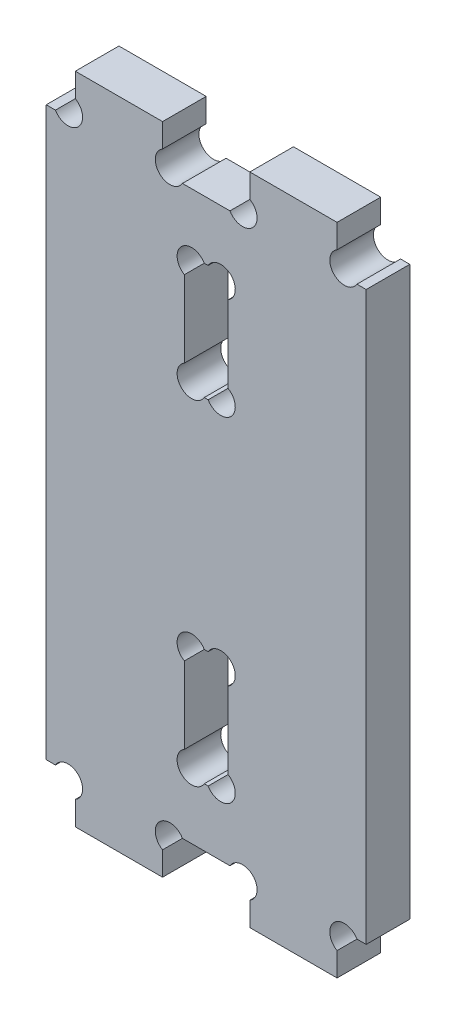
ISO-10303-21;
HEADER;
FILE_DESCRIPTION(('STEP AP214'),'2;1');
FILE_NAME('part.step','',(''),(''),'','','');
FILE_SCHEMA(('AUTOMOTIVE_DESIGN { 1 0 10303 214 1 1 1 1 }'));
ENDSEC;
DATA;
#1=APPLICATION_CONTEXT('core data for automotive mechanical design processes');
#2=APPLICATION_PROTOCOL_DEFINITION('international standard','automotive_design',2000,#1);
#3=PRODUCT_CONTEXT('',#1,'mechanical');
#4=PRODUCT('Part','Part','',(#3));
#5=PRODUCT_RELATED_PRODUCT_CATEGORY('part','',(#4));
#6=PRODUCT_DEFINITION_FORMATION('','',#4);
#7=PRODUCT_DEFINITION_CONTEXT('part definition',#1,'design');
#8=PRODUCT_DEFINITION('design','',#6,#7);
#9=PRODUCT_DEFINITION_SHAPE('','',#8);
#10=(LENGTH_UNIT() NAMED_UNIT(*) SI_UNIT(.MILLI.,.METRE.));
#11=(NAMED_UNIT(*) PLANE_ANGLE_UNIT() SI_UNIT($,.RADIAN.));
#12=(NAMED_UNIT(*) SI_UNIT($,.STERADIAN.) SOLID_ANGLE_UNIT());
#13=UNCERTAINTY_MEASURE_WITH_UNIT(LENGTH_MEASURE(1.E-05),#10,'distance_accuracy_value','');
#14=(GEOMETRIC_REPRESENTATION_CONTEXT(3) GLOBAL_UNCERTAINTY_ASSIGNED_CONTEXT((#13)) GLOBAL_UNIT_ASSIGNED_CONTEXT((#10,
#11,#12)) REPRESENTATION_CONTEXT('',''));
#15=CARTESIAN_POINT('',(0.,0.,0.));
#16=DIRECTION('',(0.,0.,1.));
#17=DIRECTION('',(1.,0.,0.));
#18=AXIS2_PLACEMENT_3D('',#15,#16,#17);
#19=CARTESIAN_POINT('',(0.,0.,0.));
#20=DIRECTION('',(0.,0.,-1.));
#21=DIRECTION('',(-1.,0.,0.));
#22=AXIS2_PLACEMENT_3D('',#19,#20,#21);
#23=PLANE('',#22);
#24=CARTESIAN_POINT('',(-1.00000000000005,-8.,0.));
#25=DIRECTION('',(0.,0.,1.));
#26=DIRECTION('',(1.,0.,0.));
#27=AXIS2_PLACEMENT_3D('',#24,#25,#26);
#28=CIRCLE('',#27,0.999999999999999);
#29=CARTESIAN_POINT('',(-0.133974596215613,-7.5,0.));
#30=VERTEX_POINT('',#29);
#31=CARTESIAN_POINT('',(-1.50000000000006,-8.86602540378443,0.));
#32=VERTEX_POINT('',#31);
#33=EDGE_CURVE('E561',#30,#32,#28,.T.);
#34=ORIENTED_EDGE('',*,*,#33,.T.);
#35=DIRECTION('',(0.,1.,0.));
#36=VECTOR('',#35,1.);
#37=CARTESIAN_POINT('',(-1.50000000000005,0.,0.));
#38=LINE('',#37,#36);
#39=CARTESIAN_POINT('',(-1.50000000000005,-14.1339745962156,0.));
#40=VERTEX_POINT('',#39);
#41=EDGE_CURVE('E397',#40,#32,#38,.T.);
#42=ORIENTED_EDGE('',*,*,#41,.F.);
#43=CARTESIAN_POINT('',(-1.00000000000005,-15.,0.));
#44=DIRECTION('',(0.,0.,1.));
#45=DIRECTION('',(1.,0.,0.));
#46=AXIS2_PLACEMENT_3D('',#43,#44,#45);
#47=CIRCLE('',#46,0.999999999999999);
#48=CARTESIAN_POINT('',(-0.133974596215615,-15.5,0.));
#49=VERTEX_POINT('',#48);
#50=EDGE_CURVE('E590',#40,#49,#47,.T.);
#51=ORIENTED_EDGE('',*,*,#50,.T.);
#52=DIRECTION('',(-1.,0.,0.));
#53=VECTOR('',#52,1.);
#54=CARTESIAN_POINT('',(0.,-15.5,0.));
#55=LINE('',#54,#53);
#56=CARTESIAN_POINT('',(0.133974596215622,-15.5,0.));
#57=VERTEX_POINT('',#56);
#58=EDGE_CURVE('E400',#57,#49,#55,.T.);
#59=ORIENTED_EDGE('',*,*,#58,.F.);
#60=CARTESIAN_POINT('',(1.00000000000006,-15.,0.));
#61=DIRECTION('',(0.,0.,1.));
#62=DIRECTION('',(1.,0.,0.));
#63=AXIS2_PLACEMENT_3D('',#60,#61,#62);
#64=CIRCLE('',#63,0.999999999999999);
#65=CARTESIAN_POINT('',(1.49999999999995,-14.1339745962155,0.));
#66=VERTEX_POINT('',#65);
#67=EDGE_CURVE('E580',#57,#66,#64,.T.);
#68=ORIENTED_EDGE('',*,*,#67,.T.);
#69=DIRECTION('',(0.,-1.,0.));
#70=VECTOR('',#69,1.);
#71=CARTESIAN_POINT('',(1.49999999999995,0.,0.));
#72=LINE('',#71,#70);
#73=CARTESIAN_POINT('',(1.49999999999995,-8.8660254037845,0.));
#74=VERTEX_POINT('',#73);
#75=EDGE_CURVE('E401',#74,#66,#72,.T.);
#76=ORIENTED_EDGE('',*,*,#75,.F.);
#77=CARTESIAN_POINT('',(1.00000000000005,-8.,0.));
#78=DIRECTION('',(0.,0.,1.));
#79=DIRECTION('',(1.,0.,0.));
#80=AXIS2_PLACEMENT_3D('',#77,#78,#79);
#81=CIRCLE('',#80,0.999999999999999);
#82=CARTESIAN_POINT('',(0.133974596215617,-7.5,0.));
#83=VERTEX_POINT('',#82);
#84=EDGE_CURVE('E546',#74,#83,#81,.T.);
#85=ORIENTED_EDGE('',*,*,#84,.T.);
#86=DIRECTION('',(1.,0.,0.));
#87=VECTOR('',#86,1.);
#88=CARTESIAN_POINT('',(0.,-7.5,0.));
#89=LINE('',#88,#87);
#90=EDGE_CURVE('E39',#30,#83,#89,.T.);
#91=ORIENTED_EDGE('',*,*,#90,.F.);
#92=EDGE_LOOP('',(#34,#42,#51,#59,#68,#76,#85,#91));
#93=FACE_BOUND('',#92,.T.);
#94=DIRECTION('',(-1.,0.,0.));
#95=VECTOR('',#94,1.);
#96=CARTESIAN_POINT('',(-11.,19.5,0.));
#97=LINE('',#96,#95);
#98=CARTESIAN_POINT('',(-10.3660254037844,19.5,0.));
#99=VERTEX_POINT('',#98);
#100=CARTESIAN_POINT('',(-11.,19.5,0.));
#101=VERTEX_POINT('',#100);
#102=EDGE_CURVE('E368',#99,#101,#97,.T.);
#103=ORIENTED_EDGE('',*,*,#102,.F.);
#104=CARTESIAN_POINT('',(-9.5,20.,0.));
#105=DIRECTION('',(0.,0.,1.));
#106=DIRECTION('',(1.,0.,0.));
#107=AXIS2_PLACEMENT_3D('',#104,#105,#106);
#108=CIRCLE('',#107,0.999999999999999);
#109=CARTESIAN_POINT('',(-9.,20.8660254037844,0.));
#110=VERTEX_POINT('',#109);
#111=EDGE_CURVE('E583',#99,#110,#108,.T.);
#112=ORIENTED_EDGE('',*,*,#111,.T.);
#113=DIRECTION('',(0.,-1.,0.));
#114=VECTOR('',#113,1.);
#115=CARTESIAN_POINT('',(-9.,19.5,0.));
#116=LINE('',#115,#114);
#117=CARTESIAN_POINT('',(-9.,22.5,0.));
#118=VERTEX_POINT('',#117);
#119=EDGE_CURVE('E490',#118,#110,#116,.T.);
#120=ORIENTED_EDGE('',*,*,#119,.F.);
#121=DIRECTION('',(-1.,0.,0.));
#122=VECTOR('',#121,1.);
#123=CARTESIAN_POINT('',(-9.,22.5,0.));
#124=LINE('',#123,#122);
#125=CARTESIAN_POINT('',(-3.,22.5,0.));
#126=VERTEX_POINT('',#125);
#127=EDGE_CURVE('E495',#126,#118,#124,.T.);
#128=ORIENTED_EDGE('',*,*,#127,.F.);
#129=DIRECTION('',(0.,1.,0.));
#130=VECTOR('',#129,1.);
#131=CARTESIAN_POINT('',(-3.,19.5,0.));
#132=LINE('',#131,#130);
#133=CARTESIAN_POINT('',(-3.,20.8660254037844,0.));
#134=VERTEX_POINT('',#133);
#135=EDGE_CURVE('E502',#134,#126,#132,.T.);
#136=ORIENTED_EDGE('',*,*,#135,.F.);
#137=CARTESIAN_POINT('',(-2.5,20.,0.));
#138=DIRECTION('',(0.,0.,1.));
#139=DIRECTION('',(1.,0.,0.));
#140=AXIS2_PLACEMENT_3D('',#137,#138,#139);
#141=CIRCLE('',#140,0.999999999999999);
#142=CARTESIAN_POINT('',(-1.63397459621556,19.5,0.));
#143=VERTEX_POINT('',#142);
#144=EDGE_CURVE('E612',#134,#143,#141,.T.);
#145=ORIENTED_EDGE('',*,*,#144,.T.);
#146=CARTESIAN_POINT('',(1.63397459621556,19.5,0.));
#147=VERTEX_POINT('',#146);
#148=EDGE_CURVE('E373',#147,#143,#97,.T.);
#149=ORIENTED_EDGE('',*,*,#148,.F.);
#150=CARTESIAN_POINT('',(2.5,20.,0.));
#151=DIRECTION('',(0.,0.,1.));
#152=DIRECTION('',(1.,0.,0.));
#153=AXIS2_PLACEMENT_3D('',#150,#151,#152);
#154=CIRCLE('',#153,0.999999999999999);
#155=CARTESIAN_POINT('',(3.,20.8660254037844,0.));
#156=VERTEX_POINT('',#155);
#157=EDGE_CURVE('E602',#147,#156,#154,.T.);
#158=ORIENTED_EDGE('',*,*,#157,.T.);
#159=DIRECTION('',(0.,-1.,0.));
#160=VECTOR('',#159,1.);
#161=CARTESIAN_POINT('',(3.,19.5,0.));
#162=LINE('',#161,#160);
#163=CARTESIAN_POINT('',(3.,22.5,0.));
#164=VERTEX_POINT('',#163);
#165=EDGE_CURVE('E474',#164,#156,#162,.T.);
#166=ORIENTED_EDGE('',*,*,#165,.F.);
#167=DIRECTION('',(-1.,0.,0.));
#168=VECTOR('',#167,1.);
#169=CARTESIAN_POINT('',(9.,22.5,0.));
#170=LINE('',#169,#168);
#171=CARTESIAN_POINT('',(9.,22.5,0.));
#172=VERTEX_POINT('',#171);
#173=EDGE_CURVE('E481',#172,#164,#170,.T.);
#174=ORIENTED_EDGE('',*,*,#173,.F.);
#175=DIRECTION('',(0.,1.,0.));
#176=VECTOR('',#175,1.);
#177=CARTESIAN_POINT('',(9.,19.5,0.));
#178=LINE('',#177,#176);
#179=CARTESIAN_POINT('',(9.,20.8660254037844,0.));
#180=VERTEX_POINT('',#179);
#181=EDGE_CURVE('E470',#180,#172,#178,.T.);
#182=ORIENTED_EDGE('',*,*,#181,.F.);
#183=CARTESIAN_POINT('',(9.5,20.,0.));
#184=DIRECTION('',(0.,0.,1.));
#185=DIRECTION('',(1.,0.,0.));
#186=AXIS2_PLACEMENT_3D('',#183,#184,#185);
#187=CIRCLE('',#186,0.999999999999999);
#188=CARTESIAN_POINT('',(10.3660254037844,19.5,0.));
#189=VERTEX_POINT('',#188);
#190=EDGE_CURVE('E634',#180,#189,#187,.T.);
#191=ORIENTED_EDGE('',*,*,#190,.T.);
#192=CARTESIAN_POINT('',(11.,19.5,0.));
#193=VERTEX_POINT('',#192);
#194=EDGE_CURVE('E369',#193,#189,#97,.T.);
#195=ORIENTED_EDGE('',*,*,#194,.F.);
#196=DIRECTION('',(0.,1.,0.));
#197=VECTOR('',#196,1.);
#198=CARTESIAN_POINT('',(11.,-19.5,0.));
#199=LINE('',#198,#197);
#200=CARTESIAN_POINT('',(11.,-19.5,0.));
#201=VERTEX_POINT('',#200);
#202=EDGE_CURVE('E343',#201,#193,#199,.T.);
#203=ORIENTED_EDGE('',*,*,#202,.F.);
#204=DIRECTION('',(1.,0.,0.));
#205=VECTOR('',#204,1.);
#206=CARTESIAN_POINT('',(-11.,-19.5,0.));
#207=LINE('',#206,#205);
#208=CARTESIAN_POINT('',(10.3660254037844,-19.5,0.));
#209=VERTEX_POINT('',#208);
#210=EDGE_CURVE('E375',#209,#201,#207,.T.);
#211=ORIENTED_EDGE('',*,*,#210,.F.);
#212=CARTESIAN_POINT('',(9.50000000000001,-20.,0.));
#213=DIRECTION('',(0.,0.,1.));
#214=DIRECTION('',(1.,0.,0.));
#215=AXIS2_PLACEMENT_3D('',#212,#213,#214);
#216=CIRCLE('',#215,0.999999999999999);
#217=CARTESIAN_POINT('',(9.00000000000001,-20.8660254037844,0.));
#218=VERTEX_POINT('',#217);
#219=EDGE_CURVE('E645',#209,#218,#216,.T.);
#220=ORIENTED_EDGE('',*,*,#219,.T.);
#221=DIRECTION('',(0.,1.,0.));
#222=VECTOR('',#221,1.);
#223=CARTESIAN_POINT('',(9.00000000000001,-19.5,0.));
#224=LINE('',#223,#222);
#225=CARTESIAN_POINT('',(9.00000000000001,-22.5,0.));
#226=VERTEX_POINT('',#225);
#227=EDGE_CURVE('E450',#226,#218,#224,.T.);
#228=ORIENTED_EDGE('',*,*,#227,.F.);
#229=DIRECTION('',(1.,0.,0.));
#230=VECTOR('',#229,1.);
#231=CARTESIAN_POINT('',(9.00000000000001,-22.5,0.));
#232=LINE('',#231,#230);
#233=CARTESIAN_POINT('',(3.00000000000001,-22.5,0.));
#234=VERTEX_POINT('',#233);
#235=EDGE_CURVE('E455',#234,#226,#232,.T.);
#236=ORIENTED_EDGE('',*,*,#235,.F.);
#237=DIRECTION('',(0.,-1.,0.));
#238=VECTOR('',#237,1.);
#239=CARTESIAN_POINT('',(3.00000000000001,-19.5,0.));
#240=LINE('',#239,#238);
#241=CARTESIAN_POINT('',(3.00000000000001,-20.8660254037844,0.));
#242=VERTEX_POINT('',#241);
#243=EDGE_CURVE('E462',#242,#234,#240,.T.);
#244=ORIENTED_EDGE('',*,*,#243,.F.);
#245=CARTESIAN_POINT('',(2.50000000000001,-20.,0.));
#246=DIRECTION('',(0.,0.,1.));
#247=DIRECTION('',(1.,0.,0.));
#248=AXIS2_PLACEMENT_3D('',#245,#246,#247);
#249=CIRCLE('',#248,0.999999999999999);
#250=CARTESIAN_POINT('',(1.63397459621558,-19.5,0.));
#251=VERTEX_POINT('',#250);
#252=EDGE_CURVE('E419',#242,#251,#249,.T.);
#253=ORIENTED_EDGE('',*,*,#252,.T.);
#254=CARTESIAN_POINT('',(-1.63397459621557,-19.5,0.));
#255=VERTEX_POINT('',#254);
#256=EDGE_CURVE('E378',#255,#251,#207,.T.);
#257=ORIENTED_EDGE('',*,*,#256,.F.);
#258=CARTESIAN_POINT('',(-2.5,-20.,0.));
#259=DIRECTION('',(0.,0.,1.));
#260=DIRECTION('',(1.,0.,0.));
#261=AXIS2_PLACEMENT_3D('',#258,#259,#260);
#262=CIRCLE('',#261,0.999999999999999);
#263=CARTESIAN_POINT('',(-3.,-20.8660254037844,0.));
#264=VERTEX_POINT('',#263);
#265=EDGE_CURVE('E665',#255,#264,#262,.T.);
#266=ORIENTED_EDGE('',*,*,#265,.T.);
#267=DIRECTION('',(0.,1.,0.));
#268=VECTOR('',#267,1.);
#269=CARTESIAN_POINT('',(-3.,-19.5,0.));
#270=LINE('',#269,#268);
#271=CARTESIAN_POINT('',(-3.,-22.5,0.));
#272=VERTEX_POINT('',#271);
#273=EDGE_CURVE('E434',#272,#264,#270,.T.);
#274=ORIENTED_EDGE('',*,*,#273,.F.);
#275=DIRECTION('',(1.,0.,0.));
#276=VECTOR('',#275,1.);
#277=CARTESIAN_POINT('',(-9.,-22.5,0.));
#278=LINE('',#277,#276);
#279=CARTESIAN_POINT('',(-9.,-22.5,0.));
#280=VERTEX_POINT('',#279);
#281=EDGE_CURVE('E441',#280,#272,#278,.T.);
#282=ORIENTED_EDGE('',*,*,#281,.F.);
#283=DIRECTION('',(0.,-1.,0.));
#284=VECTOR('',#283,1.);
#285=CARTESIAN_POINT('',(-9.,-19.5,0.));
#286=LINE('',#285,#284);
#287=CARTESIAN_POINT('',(-9.,-20.8660254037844,0.));
#288=VERTEX_POINT('',#287);
#289=EDGE_CURVE('E430',#288,#280,#286,.T.);
#290=ORIENTED_EDGE('',*,*,#289,.F.);
#291=CARTESIAN_POINT('',(-9.5,-20.,0.));
#292=DIRECTION('',(0.,0.,1.));
#293=DIRECTION('',(1.,0.,0.));
#294=AXIS2_PLACEMENT_3D('',#291,#292,#293);
#295=CIRCLE('',#294,0.999999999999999);
#296=CARTESIAN_POINT('',(-10.3660254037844,-19.5,0.));
#297=VERTEX_POINT('',#296);
#298=EDGE_CURVE('E407',#288,#297,#295,.T.);
#299=ORIENTED_EDGE('',*,*,#298,.T.);
#300=CARTESIAN_POINT('',(-11.,-19.5,0.));
#301=VERTEX_POINT('',#300);
#302=EDGE_CURVE('E353',#301,#297,#207,.T.);
#303=ORIENTED_EDGE('',*,*,#302,.F.);
#304=DIRECTION('',(0.,-1.,0.));
#305=VECTOR('',#304,1.);
#306=CARTESIAN_POINT('',(-11.,-19.5,0.));
#307=LINE('',#306,#305);
#308=EDGE_CURVE('E372',#101,#301,#307,.T.);
#309=ORIENTED_EDGE('',*,*,#308,.F.);
#310=EDGE_LOOP('',(#103,#112,#120,#128,#136,#145,#149,#158,#166,#174,#182,#191,#195,#203,#211,
#220,#228,#236,#244,#253,#257,#266,#274,#282,#290,#299,#303,#309));
#311=FACE_BOUND('',#310,.T.);
#312=DIRECTION('',(1.,0.,0.));
#313=VECTOR('',#312,1.);
#314=CARTESIAN_POINT('',(0.,15.5,0.));
#315=LINE('',#314,#313);
#316=CARTESIAN_POINT('',(-0.133974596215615,15.5,0.));
#317=VERTEX_POINT('',#316);
#318=CARTESIAN_POINT('',(0.133974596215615,15.5,0.));
#319=VERTEX_POINT('',#318);
#320=EDGE_CURVE('E390',#317,#319,#315,.T.);
#321=ORIENTED_EDGE('',*,*,#320,.F.);
#322=CARTESIAN_POINT('',(-1.00000000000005,15.,0.));
#323=DIRECTION('',(0.,0.,1.));
#324=DIRECTION('',(1.,0.,0.));
#325=AXIS2_PLACEMENT_3D('',#322,#323,#324);
#326=CIRCLE('',#325,0.999999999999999);
#327=CARTESIAN_POINT('',(-1.50000000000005,14.1339745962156,0.));
#328=VERTEX_POINT('',#327);
#329=EDGE_CURVE('E323',#317,#328,#326,.T.);
#330=ORIENTED_EDGE('',*,*,#329,.T.);
#331=DIRECTION('',(0.,1.,0.));
#332=VECTOR('',#331,1.);
#333=CARTESIAN_POINT('',(-1.50000000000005,0.,0.));
#334=LINE('',#333,#332);
#335=CARTESIAN_POINT('',(-1.50000000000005,8.86602540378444,0.));
#336=VERTEX_POINT('',#335);
#337=EDGE_CURVE('E332',#336,#328,#334,.T.);
#338=ORIENTED_EDGE('',*,*,#337,.F.);
#339=CARTESIAN_POINT('',(-1.00000000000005,8.,0.));
#340=DIRECTION('',(0.,0.,1.));
#341=DIRECTION('',(1.,0.,0.));
#342=AXIS2_PLACEMENT_3D('',#339,#340,#341);
#343=CIRCLE('',#342,0.999999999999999);
#344=CARTESIAN_POINT('',(-0.133974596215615,7.5,0.));
#345=VERTEX_POINT('',#344);
#346=EDGE_CURVE('E551',#336,#345,#343,.T.);
#347=ORIENTED_EDGE('',*,*,#346,.T.);
#348=DIRECTION('',(-1.,0.,0.));
#349=VECTOR('',#348,1.);
#350=CARTESIAN_POINT('',(0.,7.5,0.));
#351=LINE('',#350,#349);
#352=CARTESIAN_POINT('',(0.133974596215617,7.5,0.));
#353=VERTEX_POINT('',#352);
#354=EDGE_CURVE('E393',#353,#345,#351,.T.);
#355=ORIENTED_EDGE('',*,*,#354,.F.);
#356=CARTESIAN_POINT('',(1.00000000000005,8.,0.));
#357=DIRECTION('',(0.,0.,1.));
#358=DIRECTION('',(1.,0.,0.));
#359=AXIS2_PLACEMENT_3D('',#356,#357,#358);
#360=CIRCLE('',#359,0.999999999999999);
#361=CARTESIAN_POINT('',(1.49999999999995,8.8660254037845,0.));
#362=VERTEX_POINT('',#361);
#363=EDGE_CURVE('E543',#353,#362,#360,.T.);
#364=ORIENTED_EDGE('',*,*,#363,.T.);
#365=DIRECTION('',(0.,-1.,0.));
#366=VECTOR('',#365,1.);
#367=CARTESIAN_POINT('',(1.49999999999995,0.,0.));
#368=LINE('',#367,#366);
#369=CARTESIAN_POINT('',(1.49999999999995,14.1339745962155,0.));
#370=VERTEX_POINT('',#369);
#371=EDGE_CURVE('E395',#370,#362,#368,.T.);
#372=ORIENTED_EDGE('',*,*,#371,.F.);
#373=CARTESIAN_POINT('',(1.00000000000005,15.,0.));
#374=DIRECTION('',(0.,0.,1.));
#375=DIRECTION('',(1.,0.,0.));
#376=AXIS2_PLACEMENT_3D('',#373,#374,#375);
#377=CIRCLE('',#376,0.999999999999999);
#378=EDGE_CURVE('E333',#370,#319,#377,.T.);
#379=ORIENTED_EDGE('',*,*,#378,.T.);
#380=EDGE_LOOP('',(#321,#330,#338,#347,#355,#364,#372,#379));
#381=FACE_BOUND('',#380,.T.);
#382=ADVANCED_FACE('F35',(#93,#311,#381),#23,.T.);
#383=CARTESIAN_POINT('',(0.,0.,3.));
#384=DIRECTION('',(0.,0.,-1.));
#385=DIRECTION('',(-1.,0.,0.));
#386=AXIS2_PLACEMENT_3D('',#383,#384,#385);
#387=PLANE('',#386);
#388=CARTESIAN_POINT('',(-9.5,20.,3.));
#389=DIRECTION('',(0.,0.,1.));
#390=DIRECTION('',(1.,0.,0.));
#391=AXIS2_PLACEMENT_3D('',#388,#389,#390);
#392=CIRCLE('',#391,0.999999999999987);
#393=CARTESIAN_POINT('',(-10.3660254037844,19.5,3.));
#394=VERTEX_POINT('',#393);
#395=CARTESIAN_POINT('',(-9.,20.8660254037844,3.));
#396=VERTEX_POINT('',#395);
#397=EDGE_CURVE('E600',#394,#396,#392,.T.);
#398=ORIENTED_EDGE('',*,*,#397,.F.);
#399=DIRECTION('',(-1.,0.,0.));
#400=VECTOR('',#399,1.);
#401=CARTESIAN_POINT('',(-11.,19.5,3.));
#402=LINE('',#401,#400);
#403=CARTESIAN_POINT('',(-11.,19.5,3.));
#404=VERTEX_POINT('',#403);
#405=EDGE_CURVE('E352',#394,#404,#402,.T.);
#406=ORIENTED_EDGE('',*,*,#405,.T.);
#407=DIRECTION('',(0.,-1.,0.));
#408=VECTOR('',#407,1.);
#409=CARTESIAN_POINT('',(-11.,-19.5,3.));
#410=LINE('',#409,#408);
#411=CARTESIAN_POINT('',(-11.,-19.5,3.));
#412=VERTEX_POINT('',#411);
#413=EDGE_CURVE('E357',#404,#412,#410,.T.);
#414=ORIENTED_EDGE('',*,*,#413,.T.);
#415=DIRECTION('',(1.,0.,0.));
#416=VECTOR('',#415,1.);
#417=CARTESIAN_POINT('',(-11.,-19.5,3.));
#418=LINE('',#417,#416);
#419=CARTESIAN_POINT('',(-10.3660254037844,-19.5,3.));
#420=VERTEX_POINT('',#419);
#421=EDGE_CURVE('E361',#412,#420,#418,.T.);
#422=ORIENTED_EDGE('',*,*,#421,.T.);
#423=CARTESIAN_POINT('',(-9.5,-20.,3.));
#424=DIRECTION('',(0.,0.,1.));
#425=DIRECTION('',(1.,0.,0.));
#426=AXIS2_PLACEMENT_3D('',#423,#424,#425);
#427=CIRCLE('',#426,0.999999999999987);
#428=CARTESIAN_POINT('',(-9.,-20.8660254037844,3.));
#429=VERTEX_POINT('',#428);
#430=EDGE_CURVE('E414',#429,#420,#427,.T.);
#431=ORIENTED_EDGE('',*,*,#430,.F.);
#432=DIRECTION('',(0.,-1.,0.));
#433=VECTOR('',#432,1.);
#434=CARTESIAN_POINT('',(-9.,-19.5,3.));
#435=LINE('',#434,#433);
#436=CARTESIAN_POINT('',(-9.,-22.5,3.));
#437=VERTEX_POINT('',#436);
#438=EDGE_CURVE('E431',#429,#437,#435,.T.);
#439=ORIENTED_EDGE('',*,*,#438,.T.);
#440=DIRECTION('',(1.,0.,0.));
#441=VECTOR('',#440,1.);
#442=CARTESIAN_POINT('',(-9.,-22.5,3.));
#443=LINE('',#442,#441);
#444=CARTESIAN_POINT('',(-3.,-22.5,3.));
#445=VERTEX_POINT('',#444);
#446=EDGE_CURVE('E433',#437,#445,#443,.T.);
#447=ORIENTED_EDGE('',*,*,#446,.T.);
#448=DIRECTION('',(0.,1.,0.));
#449=VECTOR('',#448,1.);
#450=CARTESIAN_POINT('',(-3.,-19.5,3.));
#451=LINE('',#450,#449);
#452=CARTESIAN_POINT('',(-3.,-20.8660254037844,3.));
#453=VERTEX_POINT('',#452);
#454=EDGE_CURVE('E436',#445,#453,#451,.T.);
#455=ORIENTED_EDGE('',*,*,#454,.T.);
#456=CARTESIAN_POINT('',(-2.5,-20.,3.));
#457=DIRECTION('',(0.,0.,1.));
#458=DIRECTION('',(1.,0.,0.));
#459=AXIS2_PLACEMENT_3D('',#456,#457,#458);
#460=CIRCLE('',#459,0.999999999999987);
#461=CARTESIAN_POINT('',(-1.63397459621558,-19.5,3.));
#462=VERTEX_POINT('',#461);
#463=EDGE_CURVE('E663',#462,#453,#460,.T.);
#464=ORIENTED_EDGE('',*,*,#463,.F.);
#465=CARTESIAN_POINT('',(1.63397459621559,-19.5,3.));
#466=VERTEX_POINT('',#465);
#467=EDGE_CURVE('E365',#462,#466,#418,.T.);
#468=ORIENTED_EDGE('',*,*,#467,.T.);
#469=CARTESIAN_POINT('',(2.50000000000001,-20.,3.));
#470=DIRECTION('',(0.,0.,1.));
#471=DIRECTION('',(1.,0.,0.));
#472=AXIS2_PLACEMENT_3D('',#469,#470,#471);
#473=CIRCLE('',#472,0.999999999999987);
#474=CARTESIAN_POINT('',(3.00000000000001,-20.8660254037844,3.));
#475=VERTEX_POINT('',#474);
#476=EDGE_CURVE('E624',#475,#466,#473,.T.);
#477=ORIENTED_EDGE('',*,*,#476,.F.);
#478=DIRECTION('',(0.,-1.,0.));
#479=VECTOR('',#478,1.);
#480=CARTESIAN_POINT('',(3.00000000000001,-19.5,3.));
#481=LINE('',#480,#479);
#482=CARTESIAN_POINT('',(3.00000000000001,-22.5,3.));
#483=VERTEX_POINT('',#482);
#484=EDGE_CURVE('E454',#475,#483,#481,.T.);
#485=ORIENTED_EDGE('',*,*,#484,.T.);
#486=DIRECTION('',(1.,0.,0.));
#487=VECTOR('',#486,1.);
#488=CARTESIAN_POINT('',(9.00000000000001,-22.5,3.));
#489=LINE('',#488,#487);
#490=CARTESIAN_POINT('',(9.00000000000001,-22.5,3.));
#491=VERTEX_POINT('',#490);
#492=EDGE_CURVE('E457',#483,#491,#489,.T.);
#493=ORIENTED_EDGE('',*,*,#492,.T.);
#494=DIRECTION('',(0.,1.,0.));
#495=VECTOR('',#494,1.);
#496=CARTESIAN_POINT('',(9.00000000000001,-19.5,3.));
#497=LINE('',#496,#495);
#498=CARTESIAN_POINT('',(9.00000000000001,-20.8660254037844,3.));
#499=VERTEX_POINT('',#498);
#500=EDGE_CURVE('E451',#491,#499,#497,.T.);
#501=ORIENTED_EDGE('',*,*,#500,.T.);
#502=CARTESIAN_POINT('',(9.50000000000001,-20.,3.));
#503=DIRECTION('',(0.,0.,1.));
#504=DIRECTION('',(1.,0.,0.));
#505=AXIS2_PLACEMENT_3D('',#502,#503,#504);
#506=CIRCLE('',#505,0.999999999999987);
#507=CARTESIAN_POINT('',(10.3660254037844,-19.5,3.));
#508=VERTEX_POINT('',#507);
#509=EDGE_CURVE('E643',#508,#499,#506,.T.);
#510=ORIENTED_EDGE('',*,*,#509,.F.);
#511=CARTESIAN_POINT('',(11.,-19.5,3.));
#512=VERTEX_POINT('',#511);
#513=EDGE_CURVE('E360',#508,#512,#418,.T.);
#514=ORIENTED_EDGE('',*,*,#513,.T.);
#515=DIRECTION('',(0.,1.,0.));
#516=VECTOR('',#515,1.);
#517=CARTESIAN_POINT('',(11.,-19.5,3.));
#518=LINE('',#517,#516);
#519=CARTESIAN_POINT('',(11.,19.5,3.));
#520=VERTEX_POINT('',#519);
#521=EDGE_CURVE('E349',#512,#520,#518,.T.);
#522=ORIENTED_EDGE('',*,*,#521,.T.);
#523=CARTESIAN_POINT('',(10.3660254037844,19.5,3.));
#524=VERTEX_POINT('',#523);
#525=EDGE_CURVE('E354',#520,#524,#402,.T.);
#526=ORIENTED_EDGE('',*,*,#525,.T.);
#527=CARTESIAN_POINT('',(9.5,20.,3.));
#528=DIRECTION('',(0.,0.,1.));
#529=DIRECTION('',(1.,0.,0.));
#530=AXIS2_PLACEMENT_3D('',#527,#528,#529);
#531=CIRCLE('',#530,0.999999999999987);
#532=CARTESIAN_POINT('',(9.,20.8660254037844,3.));
#533=VERTEX_POINT('',#532);
#534=EDGE_CURVE('E632',#533,#524,#531,.T.);
#535=ORIENTED_EDGE('',*,*,#534,.F.);
#536=DIRECTION('',(0.,1.,0.));
#537=VECTOR('',#536,1.);
#538=CARTESIAN_POINT('',(9.,19.5,3.));
#539=LINE('',#538,#537);
#540=CARTESIAN_POINT('',(9.,22.5,3.));
#541=VERTEX_POINT('',#540);
#542=EDGE_CURVE('E471',#533,#541,#539,.T.);
#543=ORIENTED_EDGE('',*,*,#542,.T.);
#544=DIRECTION('',(-1.,0.,0.));
#545=VECTOR('',#544,1.);
#546=CARTESIAN_POINT('',(9.,22.5,3.));
#547=LINE('',#546,#545);
#548=CARTESIAN_POINT('',(3.,22.5,3.));
#549=VERTEX_POINT('',#548);
#550=EDGE_CURVE('E473',#541,#549,#547,.T.);
#551=ORIENTED_EDGE('',*,*,#550,.T.);
#552=DIRECTION('',(0.,-1.,0.));
#553=VECTOR('',#552,1.);
#554=CARTESIAN_POINT('',(3.,19.5,3.));
#555=LINE('',#554,#553);
#556=CARTESIAN_POINT('',(3.,20.8660254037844,3.));
#557=VERTEX_POINT('',#556);
#558=EDGE_CURVE('E476',#549,#557,#555,.T.);
#559=ORIENTED_EDGE('',*,*,#558,.T.);
#560=CARTESIAN_POINT('',(2.5,20.,3.));
#561=DIRECTION('',(0.,0.,1.));
#562=DIRECTION('',(1.,0.,0.));
#563=AXIS2_PLACEMENT_3D('',#560,#561,#562);
#564=CIRCLE('',#563,0.999999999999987);
#565=CARTESIAN_POINT('',(1.63397459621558,19.5,3.));
#566=VERTEX_POINT('',#565);
#567=EDGE_CURVE('E622',#566,#557,#564,.T.);
#568=ORIENTED_EDGE('',*,*,#567,.F.);
#569=CARTESIAN_POINT('',(-1.63397459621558,19.5,3.));
#570=VERTEX_POINT('',#569);
#571=EDGE_CURVE('E358',#566,#570,#402,.T.);
#572=ORIENTED_EDGE('',*,*,#571,.T.);
#573=CARTESIAN_POINT('',(-2.5,20.,3.));
#574=DIRECTION('',(0.,0.,1.));
#575=DIRECTION('',(1.,0.,0.));
#576=AXIS2_PLACEMENT_3D('',#573,#574,#575);
#577=CIRCLE('',#576,0.999999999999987);
#578=CARTESIAN_POINT('',(-3.,20.8660254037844,3.));
#579=VERTEX_POINT('',#578);
#580=EDGE_CURVE('E610',#579,#570,#577,.T.);
#581=ORIENTED_EDGE('',*,*,#580,.F.);
#582=DIRECTION('',(0.,1.,0.));
#583=VECTOR('',#582,1.);
#584=CARTESIAN_POINT('',(-3.,19.5,3.));
#585=LINE('',#584,#583);
#586=CARTESIAN_POINT('',(-3.,22.5,3.));
#587=VERTEX_POINT('',#586);
#588=EDGE_CURVE('E494',#579,#587,#585,.T.);
#589=ORIENTED_EDGE('',*,*,#588,.T.);
#590=DIRECTION('',(-1.,0.,0.));
#591=VECTOR('',#590,1.);
#592=CARTESIAN_POINT('',(-9.,22.5,3.));
#593=LINE('',#592,#591);
#594=CARTESIAN_POINT('',(-9.,22.5,3.));
#595=VERTEX_POINT('',#594);
#596=EDGE_CURVE('E497',#587,#595,#593,.T.);
#597=ORIENTED_EDGE('',*,*,#596,.T.);
#598=DIRECTION('',(0.,-1.,0.));
#599=VECTOR('',#598,1.);
#600=CARTESIAN_POINT('',(-9.,19.5,3.));
#601=LINE('',#600,#599);
#602=EDGE_CURVE('E491',#595,#396,#601,.T.);
#603=ORIENTED_EDGE('',*,*,#602,.T.);
#604=EDGE_LOOP('',(#398,#406,#414,#422,#431,#439,#447,#455,#464,#468,#477,#485,#493,#501,#510,
#514,#522,#526,#535,#543,#551,#559,#568,#572,#581,#589,#597,#603));
#605=FACE_BOUND('',#604,.T.);
#606=DIRECTION('',(0.,-1.,0.));
#607=VECTOR('',#606,1.);
#608=CARTESIAN_POINT('',(-1.50000000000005,-7.5,3.));
#609=LINE('',#608,#607);
#610=CARTESIAN_POINT('',(-1.50000000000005,-8.86602540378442,3.));
#611=VERTEX_POINT('',#610);
#612=CARTESIAN_POINT('',(-1.50000000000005,-14.1339745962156,3.));
#613=VERTEX_POINT('',#612);
#614=EDGE_CURVE('E513',#611,#613,#609,.T.);
#615=ORIENTED_EDGE('',*,*,#614,.F.);
#616=CARTESIAN_POINT('',(-1.00000000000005,-8.,3.));
#617=DIRECTION('',(0.,0.,1.));
#618=DIRECTION('',(1.,0.,0.));
#619=AXIS2_PLACEMENT_3D('',#616,#617,#618);
#620=CIRCLE('',#619,0.999999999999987);
#621=CARTESIAN_POINT('',(-0.133974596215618,-7.5,3.));
#622=VERTEX_POINT('',#621);
#623=EDGE_CURVE('E559',#622,#611,#620,.T.);
#624=ORIENTED_EDGE('',*,*,#623,.F.);
#625=DIRECTION('',(-1.,0.,0.));
#626=VECTOR('',#625,1.);
#627=CARTESIAN_POINT('',(-1.50000000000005,-7.5,3.));
#628=LINE('',#627,#626);
#629=CARTESIAN_POINT('',(0.133974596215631,-7.5,3.));
#630=VERTEX_POINT('',#629);
#631=EDGE_CURVE('E510',#630,#622,#628,.T.);
#632=ORIENTED_EDGE('',*,*,#631,.F.);
#633=CARTESIAN_POINT('',(1.00000000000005,-8.,3.));
#634=DIRECTION('',(0.,0.,1.));
#635=DIRECTION('',(1.,0.,0.));
#636=AXIS2_PLACEMENT_3D('',#633,#634,#635);
#637=CIRCLE('',#636,0.999999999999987);
#638=CARTESIAN_POINT('',(1.49999999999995,-8.86602540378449,3.));
#639=VERTEX_POINT('',#638);
#640=EDGE_CURVE('E570',#639,#630,#637,.T.);
#641=ORIENTED_EDGE('',*,*,#640,.F.);
#642=DIRECTION('',(0.,1.,0.));
#643=VECTOR('',#642,1.);
#644=CARTESIAN_POINT('',(1.49999999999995,-7.5,3.));
#645=LINE('',#644,#643);
#646=CARTESIAN_POINT('',(1.49999999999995,-14.1339745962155,3.));
#647=VERTEX_POINT('',#646);
#648=EDGE_CURVE('E518',#647,#639,#645,.T.);
#649=ORIENTED_EDGE('',*,*,#648,.F.);
#650=CARTESIAN_POINT('',(1.00000000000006,-15.,3.));
#651=DIRECTION('',(0.,0.,1.));
#652=DIRECTION('',(1.,0.,0.));
#653=AXIS2_PLACEMENT_3D('',#650,#651,#652);
#654=CIRCLE('',#653,0.999999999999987);
#655=CARTESIAN_POINT('',(0.133974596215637,-15.5,3.));
#656=VERTEX_POINT('',#655);
#657=EDGE_CURVE('E572',#656,#647,#654,.T.);
#658=ORIENTED_EDGE('',*,*,#657,.F.);
#659=DIRECTION('',(1.,0.,0.));
#660=VECTOR('',#659,1.);
#661=CARTESIAN_POINT('',(-1.50000000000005,-15.5,3.));
#662=LINE('',#661,#660);
#663=CARTESIAN_POINT('',(-0.133974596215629,-15.5,3.));
#664=VERTEX_POINT('',#663);
#665=EDGE_CURVE('E515',#664,#656,#662,.T.);
#666=ORIENTED_EDGE('',*,*,#665,.F.);
#667=CARTESIAN_POINT('',(-1.00000000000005,-15.,3.));
#668=DIRECTION('',(0.,0.,1.));
#669=DIRECTION('',(1.,0.,0.));
#670=AXIS2_PLACEMENT_3D('',#667,#668,#669);
#671=CIRCLE('',#670,0.999999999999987);
#672=EDGE_CURVE('E588',#613,#664,#671,.T.);
#673=ORIENTED_EDGE('',*,*,#672,.F.);
#674=EDGE_LOOP('',(#615,#624,#632,#641,#649,#658,#666,#673));
#675=FACE_BOUND('',#674,.T.);
#676=CARTESIAN_POINT('',(-1.00000000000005,15.,3.));
#677=DIRECTION('',(0.,0.,1.));
#678=DIRECTION('',(1.,0.,0.));
#679=AXIS2_PLACEMENT_3D('',#676,#677,#678);
#680=CIRCLE('',#679,0.999999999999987);
#681=CARTESIAN_POINT('',(-0.133974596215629,15.5,3.));
#682=VERTEX_POINT('',#681);
#683=CARTESIAN_POINT('',(-1.50000000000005,14.1339745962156,3.));
#684=VERTEX_POINT('',#683);
#685=EDGE_CURVE('E314',#682,#684,#680,.T.);
#686=ORIENTED_EDGE('',*,*,#685,.F.);
#687=DIRECTION('',(-1.,0.,0.));
#688=VECTOR('',#687,1.);
#689=CARTESIAN_POINT('',(-1.50000000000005,15.5,3.));
#690=LINE('',#689,#688);
#691=CARTESIAN_POINT('',(0.133974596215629,15.5,3.));
#692=VERTEX_POINT('',#691);
#693=EDGE_CURVE('E340',#692,#682,#690,.T.);
#694=ORIENTED_EDGE('',*,*,#693,.F.);
#695=CARTESIAN_POINT('',(1.00000000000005,15.,3.));
#696=DIRECTION('',(0.,0.,1.));
#697=DIRECTION('',(1.,0.,0.));
#698=AXIS2_PLACEMENT_3D('',#695,#696,#697);
#699=CIRCLE('',#698,0.999999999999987);
#700=CARTESIAN_POINT('',(1.49999999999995,14.1339745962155,3.));
#701=VERTEX_POINT('',#700);
#702=EDGE_CURVE('E11',#701,#692,#699,.T.);
#703=ORIENTED_EDGE('',*,*,#702,.F.);
#704=DIRECTION('',(0.,1.,0.));
#705=VECTOR('',#704,1.);
#706=CARTESIAN_POINT('',(1.49999999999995,7.5,3.));
#707=LINE('',#706,#705);
#708=CARTESIAN_POINT('',(1.49999999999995,8.86602540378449,3.));
#709=VERTEX_POINT('',#708);
#710=EDGE_CURVE('E345',#709,#701,#707,.T.);
#711=ORIENTED_EDGE('',*,*,#710,.F.);
#712=CARTESIAN_POINT('',(1.00000000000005,8.,3.));
#713=DIRECTION('',(0.,0.,1.));
#714=DIRECTION('',(1.,0.,0.));
#715=AXIS2_PLACEMENT_3D('',#712,#713,#714);
#716=CIRCLE('',#715,0.999999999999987);
#717=CARTESIAN_POINT('',(0.133974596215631,7.5,3.));
#718=VERTEX_POINT('',#717);
#719=EDGE_CURVE('E44',#718,#709,#716,.T.);
#720=ORIENTED_EDGE('',*,*,#719,.F.);
#721=DIRECTION('',(1.,0.,0.));
#722=VECTOR('',#721,1.);
#723=CARTESIAN_POINT('',(-1.50000000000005,7.5,3.));
#724=LINE('',#723,#722);
#725=CARTESIAN_POINT('',(-0.133974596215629,7.5,3.));
#726=VERTEX_POINT('',#725);
#727=EDGE_CURVE('E339',#726,#718,#724,.T.);
#728=ORIENTED_EDGE('',*,*,#727,.F.);
#729=CARTESIAN_POINT('',(-1.00000000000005,8.,3.));
#730=DIRECTION('',(0.,0.,1.));
#731=DIRECTION('',(1.,0.,0.));
#732=AXIS2_PLACEMENT_3D('',#729,#730,#731);
#733=CIRCLE('',#732,0.999999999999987);
#734=CARTESIAN_POINT('',(-1.50000000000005,8.86602540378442,3.));
#735=VERTEX_POINT('',#734);
#736=EDGE_CURVE('E338',#735,#726,#733,.T.);
#737=ORIENTED_EDGE('',*,*,#736,.F.);
#738=DIRECTION('',(0.,-1.,0.));
#739=VECTOR('',#738,1.);
#740=CARTESIAN_POINT('',(-1.50000000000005,7.5,3.));
#741=LINE('',#740,#739);
#742=EDGE_CURVE('E329',#684,#735,#741,.T.);
#743=ORIENTED_EDGE('',*,*,#742,.F.);
#744=EDGE_LOOP('',(#686,#694,#703,#711,#720,#728,#737,#743));
#745=FACE_BOUND('',#744,.T.);
#746=ADVANCED_FACE('F336',(#605,#675,#745),#387,.F.);
#747=CARTESIAN_POINT('',(-11.,-19.5,3.));
#748=DIRECTION('',(0.,1.,0.));
#749=DIRECTION('',(0.,0.,1.));
#750=AXIS2_PLACEMENT_3D('',#747,#748,#749);
#751=PLANE('',#750);
#752=ORIENTED_EDGE('',*,*,#302,.T.);
#753=DIRECTION('',(0.,0.,1.));
#754=VECTOR('',#753,1.);
#755=CARTESIAN_POINT('',(-10.3660254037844,-19.5,3.));
#756=LINE('',#755,#754);
#757=EDGE_CURVE('E426',#297,#420,#756,.T.);
#758=ORIENTED_EDGE('',*,*,#757,.T.);
#759=ORIENTED_EDGE('',*,*,#421,.F.);
#760=DIRECTION('',(0.,0.,-1.));
#761=VECTOR('',#760,1.);
#762=CARTESIAN_POINT('',(-11.,-19.5,3.));
#763=LINE('',#762,#761);
#764=EDGE_CURVE('E381',#412,#301,#763,.T.);
#765=ORIENTED_EDGE('',*,*,#764,.T.);
#766=EDGE_LOOP('',(#752,#758,#759,#765));
#767=FACE_BOUND('',#766,.T.);
#768=ADVANCED_FACE('F722',(#767),#751,.F.);
#769=ORIENTED_EDGE('',*,*,#256,.T.);
#770=DIRECTION('',(0.,0.,1.));
#771=VECTOR('',#770,1.);
#772=CARTESIAN_POINT('',(1.63397459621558,-19.5,3.));
#773=LINE('',#772,#771);
#774=EDGE_CURVE('E660',#251,#466,#773,.T.);
#775=ORIENTED_EDGE('',*,*,#774,.T.);
#776=ORIENTED_EDGE('',*,*,#467,.F.);
#777=DIRECTION('',(0.,0.,1.));
#778=VECTOR('',#777,1.);
#779=CARTESIAN_POINT('',(-1.63397459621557,-19.5,3.));
#780=LINE('',#779,#778);
#781=EDGE_CURVE('E427',#462,#255,#780,.F.);
#782=ORIENTED_EDGE('',*,*,#781,.T.);
#783=EDGE_LOOP('',(#769,#775,#776,#782));
#784=FACE_BOUND('',#783,.T.);
#785=ADVANCED_FACE('F675',(#784),#751,.F.);
#786=CARTESIAN_POINT('',(-11.,19.5,3.));
#787=DIRECTION('',(0.,-1.,0.));
#788=DIRECTION('',(0.,0.,-1.));
#789=AXIS2_PLACEMENT_3D('',#786,#787,#788);
#790=PLANE('',#789);
#791=ORIENTED_EDGE('',*,*,#194,.T.);
#792=DIRECTION('',(0.,0.,1.));
#793=VECTOR('',#792,1.);
#794=CARTESIAN_POINT('',(10.3660254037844,19.5,3.));
#795=LINE('',#794,#793);
#796=EDGE_CURVE('E640',#189,#524,#795,.T.);
#797=ORIENTED_EDGE('',*,*,#796,.T.);
#798=ORIENTED_EDGE('',*,*,#525,.F.);
#799=DIRECTION('',(0.,0.,-1.));
#800=VECTOR('',#799,1.);
#801=CARTESIAN_POINT('',(11.,19.5,3.));
#802=LINE('',#801,#800);
#803=EDGE_CURVE('E387',#520,#193,#802,.T.);
#804=ORIENTED_EDGE('',*,*,#803,.T.);
#805=EDGE_LOOP('',(#791,#797,#798,#804));
#806=FACE_BOUND('',#805,.T.);
#807=ADVANCED_FACE('F694',(#806),#790,.F.);
#808=ORIENTED_EDGE('',*,*,#148,.T.);
#809=DIRECTION('',(0.,0.,1.));
#810=VECTOR('',#809,1.);
#811=CARTESIAN_POINT('',(-1.63397459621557,19.5,3.));
#812=LINE('',#811,#810);
#813=EDGE_CURVE('E618',#143,#570,#812,.T.);
#814=ORIENTED_EDGE('',*,*,#813,.T.);
#815=ORIENTED_EDGE('',*,*,#571,.F.);
#816=DIRECTION('',(0.,0.,1.));
#817=VECTOR('',#816,1.);
#818=CARTESIAN_POINT('',(1.63397459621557,19.5,3.));
#819=LINE('',#818,#817);
#820=EDGE_CURVE('E629',#566,#147,#819,.F.);
#821=ORIENTED_EDGE('',*,*,#820,.T.);
#822=EDGE_LOOP('',(#808,#814,#815,#821));
#823=FACE_BOUND('',#822,.T.);
#824=ADVANCED_FACE('F733',(#823),#790,.F.);
#825=CARTESIAN_POINT('',(11.,-19.5,3.));
#826=DIRECTION('',(-1.,0.,0.));
#827=DIRECTION('',(0.,0.,1.));
#828=AXIS2_PLACEMENT_3D('',#825,#826,#827);
#829=PLANE('',#828);
#830=ORIENTED_EDGE('',*,*,#202,.T.);
#831=ORIENTED_EDGE('',*,*,#803,.F.);
#832=ORIENTED_EDGE('',*,*,#521,.F.);
#833=DIRECTION('',(0.,0.,-1.));
#834=VECTOR('',#833,1.);
#835=CARTESIAN_POINT('',(11.,-19.5,3.));
#836=LINE('',#835,#834);
#837=EDGE_CURVE('E364',#512,#201,#836,.T.);
#838=ORIENTED_EDGE('',*,*,#837,.T.);
#839=EDGE_LOOP('',(#830,#831,#832,#838));
#840=FACE_BOUND('',#839,.T.);
#841=ADVANCED_FACE('F37',(#840),#829,.F.);
#842=ORIENTED_EDGE('',*,*,#405,.F.);
#843=DIRECTION('',(0.,0.,1.));
#844=VECTOR('',#843,1.);
#845=CARTESIAN_POINT('',(-10.3660254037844,19.5,3.));
#846=LINE('',#845,#844);
#847=EDGE_CURVE('E607',#394,#99,#846,.F.);
#848=ORIENTED_EDGE('',*,*,#847,.T.);
#849=ORIENTED_EDGE('',*,*,#102,.T.);
#850=DIRECTION('',(0.,0.,-1.));
#851=VECTOR('',#850,1.);
#852=CARTESIAN_POINT('',(-11.,19.5,3.));
#853=LINE('',#852,#851);
#854=EDGE_CURVE('E384',#404,#101,#853,.T.);
#855=ORIENTED_EDGE('',*,*,#854,.F.);
#856=EDGE_LOOP('',(#842,#848,#849,#855));
#857=FACE_BOUND('',#856,.T.);
#858=ADVANCED_FACE('F729',(#857),#790,.F.);
#859=CARTESIAN_POINT('',(-11.,-19.5,3.));
#860=DIRECTION('',(1.,0.,0.));
#861=DIRECTION('',(0.,0.,-1.));
#862=AXIS2_PLACEMENT_3D('',#859,#860,#861);
#863=PLANE('',#862);
#864=ORIENTED_EDGE('',*,*,#308,.T.);
#865=ORIENTED_EDGE('',*,*,#764,.F.);
#866=ORIENTED_EDGE('',*,*,#413,.F.);
#867=ORIENTED_EDGE('',*,*,#854,.T.);
#868=EDGE_LOOP('',(#864,#865,#866,#867));
#869=FACE_BOUND('',#868,.T.);
#870=ADVANCED_FACE('F725',(#869),#863,.F.);
#871=ORIENTED_EDGE('',*,*,#513,.F.);
#872=DIRECTION('',(0.,0.,1.));
#873=VECTOR('',#872,1.);
#874=CARTESIAN_POINT('',(10.3660254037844,-19.5,3.));
#875=LINE('',#874,#873);
#876=EDGE_CURVE('E651',#508,#209,#875,.F.);
#877=ORIENTED_EDGE('',*,*,#876,.T.);
#878=ORIENTED_EDGE('',*,*,#210,.T.);
#879=ORIENTED_EDGE('',*,*,#837,.F.);
#880=EDGE_LOOP('',(#871,#877,#878,#879));
#881=FACE_BOUND('',#880,.T.);
#882=ADVANCED_FACE('F687',(#881),#751,.F.);
#883=CARTESIAN_POINT('',(1.49999999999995,7.5,-1.));
#884=DIRECTION('',(1.,0.,0.));
#885=DIRECTION('',(0.,1.,0.));
#886=AXIS2_PLACEMENT_3D('',#883,#884,#885);
#887=PLANE('',#886);
#888=ORIENTED_EDGE('',*,*,#710,.T.);
#889=DIRECTION('',(0.,0.,1.));
#890=VECTOR('',#889,1.);
#891=CARTESIAN_POINT('',(1.49999999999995,14.1339745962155,3.));
#892=LINE('',#891,#890);
#893=EDGE_CURVE('E59',#701,#370,#892,.F.);
#894=ORIENTED_EDGE('',*,*,#893,.T.);
#895=ORIENTED_EDGE('',*,*,#371,.T.);
#896=DIRECTION('',(0.,0.,1.));
#897=VECTOR('',#896,1.);
#898=CARTESIAN_POINT('',(1.49999999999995,8.86602540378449,3.));
#899=LINE('',#898,#897);
#900=EDGE_CURVE('E527',#362,#709,#899,.T.);
#901=ORIENTED_EDGE('',*,*,#900,.T.);
#902=EDGE_LOOP('',(#888,#894,#895,#901));
#903=FACE_BOUND('',#902,.T.);
#904=ADVANCED_FACE('F524',(#903),#887,.F.);
#905=CARTESIAN_POINT('',(-1.50000000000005,7.5,-1.));
#906=DIRECTION('',(0.,-1.,0.));
#907=DIRECTION('',(0.,0.,-1.));
#908=AXIS2_PLACEMENT_3D('',#905,#906,#907);
#909=PLANE('',#908);
#910=ORIENTED_EDGE('',*,*,#727,.T.);
#911=DIRECTION('',(0.,0.,1.));
#912=VECTOR('',#911,1.);
#913=CARTESIAN_POINT('',(0.133974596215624,7.5,3.));
#914=LINE('',#913,#912);
#915=EDGE_CURVE('E538',#718,#353,#914,.F.);
#916=ORIENTED_EDGE('',*,*,#915,.T.);
#917=ORIENTED_EDGE('',*,*,#354,.T.);
#918=DIRECTION('',(0.,0.,1.));
#919=VECTOR('',#918,1.);
#920=CARTESIAN_POINT('',(-0.133974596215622,7.5,3.));
#921=LINE('',#920,#919);
#922=EDGE_CURVE('E556',#345,#726,#921,.T.);
#923=ORIENTED_EDGE('',*,*,#922,.T.);
#924=EDGE_LOOP('',(#910,#916,#917,#923));
#925=FACE_BOUND('',#924,.T.);
#926=ADVANCED_FACE('F932',(#925),#909,.F.);
#927=CARTESIAN_POINT('',(-1.50000000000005,7.5,-1.));
#928=DIRECTION('',(-1.,0.,0.));
#929=DIRECTION('',(0.,-1.,0.));
#930=AXIS2_PLACEMENT_3D('',#927,#928,#929);
#931=PLANE('',#930);
#932=ORIENTED_EDGE('',*,*,#337,.T.);
#933=DIRECTION('',(0.,0.,1.));
#934=VECTOR('',#933,1.);
#935=CARTESIAN_POINT('',(-1.50000000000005,14.1339745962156,3.));
#936=LINE('',#935,#934);
#937=EDGE_CURVE('E317',#328,#684,#936,.T.);
#938=ORIENTED_EDGE('',*,*,#937,.T.);
#939=ORIENTED_EDGE('',*,*,#742,.T.);
#940=DIRECTION('',(0.,0.,1.));
#941=VECTOR('',#940,1.);
#942=CARTESIAN_POINT('',(-1.50000000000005,8.86602540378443,3.));
#943=LINE('',#942,#941);
#944=EDGE_CURVE('E554',#735,#336,#943,.F.);
#945=ORIENTED_EDGE('',*,*,#944,.T.);
#946=EDGE_LOOP('',(#932,#938,#939,#945));
#947=FACE_BOUND('',#946,.T.);
#948=ADVANCED_FACE('F327',(#947),#931,.F.);
#949=CARTESIAN_POINT('',(-1.50000000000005,15.5,-1.));
#950=DIRECTION('',(0.,1.,0.));
#951=DIRECTION('',(0.,0.,1.));
#952=AXIS2_PLACEMENT_3D('',#949,#950,#951);
#953=PLANE('',#952);
#954=ORIENTED_EDGE('',*,*,#693,.T.);
#955=DIRECTION('',(0.,0.,1.));
#956=VECTOR('',#955,1.);
#957=CARTESIAN_POINT('',(-0.133974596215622,15.5,3.));
#958=LINE('',#957,#956);
#959=EDGE_CURVE('E52',#682,#317,#958,.F.);
#960=ORIENTED_EDGE('',*,*,#959,.T.);
#961=ORIENTED_EDGE('',*,*,#320,.T.);
#962=DIRECTION('',(0.,0.,1.));
#963=VECTOR('',#962,1.);
#964=CARTESIAN_POINT('',(0.133974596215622,15.5,3.));
#965=LINE('',#964,#963);
#966=EDGE_CURVE('E532',#319,#692,#965,.T.);
#967=ORIENTED_EDGE('',*,*,#966,.T.);
#968=EDGE_LOOP('',(#954,#960,#961,#967));
#969=FACE_BOUND('',#968,.T.);
#970=ADVANCED_FACE('F535',(#969),#953,.F.);
#971=CARTESIAN_POINT('',(-1.50000000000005,-7.5,-1.));
#972=DIRECTION('',(0.,1.,0.));
#973=DIRECTION('',(0.,0.,1.));
#974=AXIS2_PLACEMENT_3D('',#971,#972,#973);
#975=PLANE('',#974);
#976=ORIENTED_EDGE('',*,*,#631,.T.);
#977=DIRECTION('',(0.,0.,1.));
#978=VECTOR('',#977,1.);
#979=CARTESIAN_POINT('',(-0.133974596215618,-7.5,3.));
#980=LINE('',#979,#978);
#981=EDGE_CURVE('E567',#622,#30,#980,.F.);
#982=ORIENTED_EDGE('',*,*,#981,.T.);
#983=ORIENTED_EDGE('',*,*,#90,.T.);
#984=DIRECTION('',(0.,0.,1.));
#985=VECTOR('',#984,1.);
#986=CARTESIAN_POINT('',(0.133974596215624,-7.5,3.));
#987=LINE('',#986,#985);
#988=EDGE_CURVE('E576',#83,#630,#987,.T.);
#989=ORIENTED_EDGE('',*,*,#988,.T.);
#990=EDGE_LOOP('',(#976,#982,#983,#989));
#991=FACE_BOUND('',#990,.T.);
#992=ADVANCED_FACE('F910',(#991),#975,.F.);
#993=CARTESIAN_POINT('',(1.49999999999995,-7.5,-1.));
#994=DIRECTION('',(1.,0.,0.));
#995=DIRECTION('',(0.,1.,0.));
#996=AXIS2_PLACEMENT_3D('',#993,#994,#995);
#997=PLANE('',#996);
#998=ORIENTED_EDGE('',*,*,#648,.T.);
#999=DIRECTION('',(0.,0.,1.));
#1000=VECTOR('',#999,1.);
#1001=CARTESIAN_POINT('',(1.49999999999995,-8.86602540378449,3.));
#1002=LINE('',#1001,#1000);
#1003=EDGE_CURVE('E569',#639,#74,#1002,.F.);
#1004=ORIENTED_EDGE('',*,*,#1003,.T.);
#1005=ORIENTED_EDGE('',*,*,#75,.T.);
#1006=DIRECTION('',(0.,0.,1.));
#1007=VECTOR('',#1006,1.);
#1008=CARTESIAN_POINT('',(1.49999999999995,-14.1339745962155,3.));
#1009=LINE('',#1008,#1007);
#1010=EDGE_CURVE('E586',#66,#647,#1009,.T.);
#1011=ORIENTED_EDGE('',*,*,#1010,.T.);
#1012=EDGE_LOOP('',(#998,#1004,#1005,#1011));
#1013=FACE_BOUND('',#1012,.T.);
#1014=ADVANCED_FACE('F901',(#1013),#997,.F.);
#1015=CARTESIAN_POINT('',(-1.50000000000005,-15.5,-1.));
#1016=DIRECTION('',(0.,-1.,0.));
#1017=DIRECTION('',(0.,0.,-1.));
#1018=AXIS2_PLACEMENT_3D('',#1015,#1016,#1017);
#1019=PLANE('',#1018);
#1020=ORIENTED_EDGE('',*,*,#665,.T.);
#1021=DIRECTION('',(0.,0.,1.));
#1022=VECTOR('',#1021,1.);
#1023=CARTESIAN_POINT('',(0.13397459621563,-15.5,3.));
#1024=LINE('',#1023,#1022);
#1025=EDGE_CURVE('E578',#656,#57,#1024,.F.);
#1026=ORIENTED_EDGE('',*,*,#1025,.T.);
#1027=ORIENTED_EDGE('',*,*,#58,.T.);
#1028=DIRECTION('',(0.,0.,1.));
#1029=VECTOR('',#1028,1.);
#1030=CARTESIAN_POINT('',(-0.133974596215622,-15.5,3.));
#1031=LINE('',#1030,#1029);
#1032=EDGE_CURVE('E596',#49,#664,#1031,.T.);
#1033=ORIENTED_EDGE('',*,*,#1032,.T.);
#1034=EDGE_LOOP('',(#1020,#1026,#1027,#1033));
#1035=FACE_BOUND('',#1034,.T.);
#1036=ADVANCED_FACE('F891',(#1035),#1019,.F.);
#1037=CARTESIAN_POINT('',(-1.50000000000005,-7.5,-1.));
#1038=DIRECTION('',(-1.,0.,0.));
#1039=DIRECTION('',(0.,-1.,0.));
#1040=AXIS2_PLACEMENT_3D('',#1037,#1038,#1039);
#1041=PLANE('',#1040);
#1042=ORIENTED_EDGE('',*,*,#41,.T.);
#1043=DIRECTION('',(0.,0.,1.));
#1044=VECTOR('',#1043,1.);
#1045=CARTESIAN_POINT('',(-1.50000000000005,-8.86602540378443,3.));
#1046=LINE('',#1045,#1044);
#1047=EDGE_CURVE('E564',#32,#611,#1046,.T.);
#1048=ORIENTED_EDGE('',*,*,#1047,.T.);
#1049=ORIENTED_EDGE('',*,*,#614,.T.);
#1050=DIRECTION('',(0.,0.,1.));
#1051=VECTOR('',#1050,1.);
#1052=CARTESIAN_POINT('',(-1.50000000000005,-14.1339745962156,3.));
#1053=LINE('',#1052,#1051);
#1054=EDGE_CURVE('E593',#613,#40,#1053,.F.);
#1055=ORIENTED_EDGE('',*,*,#1054,.T.);
#1056=EDGE_LOOP('',(#1042,#1048,#1049,#1055));
#1057=FACE_BOUND('',#1056,.T.);
#1058=ADVANCED_FACE('F885',(#1057),#1041,.F.);
#1059=CARTESIAN_POINT('',(-9.,19.5,3.));
#1060=DIRECTION('',(1.,0.,0.));
#1061=DIRECTION('',(0.,0.,-1.));
#1062=AXIS2_PLACEMENT_3D('',#1059,#1060,#1061);
#1063=PLANE('',#1062);
#1064=ORIENTED_EDGE('',*,*,#119,.T.);
#1065=DIRECTION('',(0.,0.,1.));
#1066=VECTOR('',#1065,1.);
#1067=CARTESIAN_POINT('',(-9.,20.8660254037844,3.));
#1068=LINE('',#1067,#1066);
#1069=EDGE_CURVE('E599',#110,#396,#1068,.T.);
#1070=ORIENTED_EDGE('',*,*,#1069,.T.);
#1071=ORIENTED_EDGE('',*,*,#602,.F.);
#1072=DIRECTION('',(0.,0.,-1.));
#1073=VECTOR('',#1072,1.);
#1074=CARTESIAN_POINT('',(-9.,22.5,3.));
#1075=LINE('',#1074,#1073);
#1076=EDGE_CURVE('E499',#595,#118,#1075,.T.);
#1077=ORIENTED_EDGE('',*,*,#1076,.T.);
#1078=EDGE_LOOP('',(#1064,#1070,#1071,#1077));
#1079=FACE_BOUND('',#1078,.T.);
#1080=ADVANCED_FACE('F753',(#1079),#1063,.F.);
#1081=CARTESIAN_POINT('',(-3.,19.5,3.));
#1082=DIRECTION('',(-1.,0.,0.));
#1083=DIRECTION('',(0.,0.,1.));
#1084=AXIS2_PLACEMENT_3D('',#1081,#1082,#1083);
#1085=PLANE('',#1084);
#1086=ORIENTED_EDGE('',*,*,#588,.F.);
#1087=DIRECTION('',(0.,0.,1.));
#1088=VECTOR('',#1087,1.);
#1089=CARTESIAN_POINT('',(-3.,20.8660254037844,3.));
#1090=LINE('',#1089,#1088);
#1091=EDGE_CURVE('E615',#579,#134,#1090,.F.);
#1092=ORIENTED_EDGE('',*,*,#1091,.T.);
#1093=ORIENTED_EDGE('',*,*,#135,.T.);
#1094=DIRECTION('',(0.,0.,-1.));
#1095=VECTOR('',#1094,1.);
#1096=CARTESIAN_POINT('',(-3.,22.5,3.));
#1097=LINE('',#1096,#1095);
#1098=EDGE_CURVE('E507',#587,#126,#1097,.T.);
#1099=ORIENTED_EDGE('',*,*,#1098,.F.);
#1100=EDGE_LOOP('',(#1086,#1092,#1093,#1099));
#1101=FACE_BOUND('',#1100,.T.);
#1102=ADVANCED_FACE('F744',(#1101),#1085,.F.);
#1103=CARTESIAN_POINT('',(-9.,22.5,3.));
#1104=DIRECTION('',(0.,-1.,0.));
#1105=DIRECTION('',(0.,0.,-1.));
#1106=AXIS2_PLACEMENT_3D('',#1103,#1104,#1105);
#1107=PLANE('',#1106);
#1108=ORIENTED_EDGE('',*,*,#127,.T.);
#1109=ORIENTED_EDGE('',*,*,#1076,.F.);
#1110=ORIENTED_EDGE('',*,*,#596,.F.);
#1111=ORIENTED_EDGE('',*,*,#1098,.T.);
#1112=EDGE_LOOP('',(#1108,#1109,#1110,#1111));
#1113=FACE_BOUND('',#1112,.T.);
#1114=ADVANCED_FACE('F756',(#1113),#1107,.F.);
#1115=CARTESIAN_POINT('',(9.,19.5,3.));
#1116=DIRECTION('',(-1.,0.,0.));
#1117=DIRECTION('',(0.,0.,1.));
#1118=AXIS2_PLACEMENT_3D('',#1115,#1116,#1117);
#1119=PLANE('',#1118);
#1120=ORIENTED_EDGE('',*,*,#542,.F.);
#1121=DIRECTION('',(0.,0.,1.));
#1122=VECTOR('',#1121,1.);
#1123=CARTESIAN_POINT('',(9.,20.8660254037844,3.));
#1124=LINE('',#1123,#1122);
#1125=EDGE_CURVE('E637',#533,#180,#1124,.F.);
#1126=ORIENTED_EDGE('',*,*,#1125,.T.);
#1127=ORIENTED_EDGE('',*,*,#181,.T.);
#1128=DIRECTION('',(0.,0.,-1.));
#1129=VECTOR('',#1128,1.);
#1130=CARTESIAN_POINT('',(9.,22.5,3.));
#1131=LINE('',#1130,#1129);
#1132=EDGE_CURVE('E487',#541,#172,#1131,.T.);
#1133=ORIENTED_EDGE('',*,*,#1132,.F.);
#1134=EDGE_LOOP('',(#1120,#1126,#1127,#1133));
#1135=FACE_BOUND('',#1134,.T.);
#1136=ADVANCED_FACE('F758',(#1135),#1119,.F.);
#1137=CARTESIAN_POINT('',(9.,22.5,3.));
#1138=DIRECTION('',(0.,-1.,0.));
#1139=DIRECTION('',(1.,0.,0.));
#1140=AXIS2_PLACEMENT_3D('',#1137,#1138,#1139);
#1141=PLANE('',#1140);
#1142=ORIENTED_EDGE('',*,*,#173,.T.);
#1143=DIRECTION('',(0.,0.,-1.));
#1144=VECTOR('',#1143,1.);
#1145=CARTESIAN_POINT('',(3.,22.5,3.));
#1146=LINE('',#1145,#1144);
#1147=EDGE_CURVE('E479',#549,#164,#1146,.T.);
#1148=ORIENTED_EDGE('',*,*,#1147,.F.);
#1149=ORIENTED_EDGE('',*,*,#550,.F.);
#1150=ORIENTED_EDGE('',*,*,#1132,.T.);
#1151=EDGE_LOOP('',(#1142,#1148,#1149,#1150));
#1152=FACE_BOUND('',#1151,.T.);
#1153=ADVANCED_FACE('F764',(#1152),#1141,.F.);
#1154=CARTESIAN_POINT('',(3.,19.5,3.));
#1155=DIRECTION('',(1.,0.,0.));
#1156=DIRECTION('',(0.,1.,0.));
#1157=AXIS2_PLACEMENT_3D('',#1154,#1155,#1156);
#1158=PLANE('',#1157);
#1159=ORIENTED_EDGE('',*,*,#165,.T.);
#1160=DIRECTION('',(0.,0.,1.));
#1161=VECTOR('',#1160,1.);
#1162=CARTESIAN_POINT('',(3.,20.8660254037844,3.));
#1163=LINE('',#1162,#1161);
#1164=EDGE_CURVE('E621',#156,#557,#1163,.T.);
#1165=ORIENTED_EDGE('',*,*,#1164,.T.);
#1166=ORIENTED_EDGE('',*,*,#558,.F.);
#1167=ORIENTED_EDGE('',*,*,#1147,.T.);
#1168=EDGE_LOOP('',(#1159,#1165,#1166,#1167));
#1169=FACE_BOUND('',#1168,.T.);
#1170=ADVANCED_FACE('F818',(#1169),#1158,.F.);
#1171=CARTESIAN_POINT('',(9.00000000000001,-19.5,3.));
#1172=DIRECTION('',(-1.,0.,0.));
#1173=DIRECTION('',(0.,0.,1.));
#1174=AXIS2_PLACEMENT_3D('',#1171,#1172,#1173);
#1175=PLANE('',#1174);
#1176=ORIENTED_EDGE('',*,*,#227,.T.);
#1177=DIRECTION('',(0.,0.,1.));
#1178=VECTOR('',#1177,1.);
#1179=CARTESIAN_POINT('',(9.00000000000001,-20.8660254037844,3.));
#1180=LINE('',#1179,#1178);
#1181=EDGE_CURVE('E648',#218,#499,#1180,.T.);
#1182=ORIENTED_EDGE('',*,*,#1181,.T.);
#1183=ORIENTED_EDGE('',*,*,#500,.F.);
#1184=DIRECTION('',(0.,0.,-1.));
#1185=VECTOR('',#1184,1.);
#1186=CARTESIAN_POINT('',(9.00000000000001,-22.5,3.));
#1187=LINE('',#1186,#1185);
#1188=EDGE_CURVE('E459',#491,#226,#1187,.T.);
#1189=ORIENTED_EDGE('',*,*,#1188,.T.);
#1190=EDGE_LOOP('',(#1176,#1182,#1183,#1189));
#1191=FACE_BOUND('',#1190,.T.);
#1192=ADVANCED_FACE('F981',(#1191),#1175,.F.);
#1193=CARTESIAN_POINT('',(3.00000000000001,-19.5,3.));
#1194=DIRECTION('',(1.,0.,0.));
#1195=DIRECTION('',(0.,1.,0.));
#1196=AXIS2_PLACEMENT_3D('',#1193,#1194,#1195);
#1197=PLANE('',#1196);
#1198=ORIENTED_EDGE('',*,*,#484,.F.);
#1199=DIRECTION('',(0.,0.,1.));
#1200=VECTOR('',#1199,1.);
#1201=CARTESIAN_POINT('',(3.00000000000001,-20.8660254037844,3.));
#1202=LINE('',#1201,#1200);
#1203=EDGE_CURVE('E654',#475,#242,#1202,.F.);
#1204=ORIENTED_EDGE('',*,*,#1203,.T.);
#1205=ORIENTED_EDGE('',*,*,#243,.T.);
#1206=DIRECTION('',(0.,0.,-1.));
#1207=VECTOR('',#1206,1.);
#1208=CARTESIAN_POINT('',(3.00000000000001,-22.5,3.));
#1209=LINE('',#1208,#1207);
#1210=EDGE_CURVE('E467',#483,#234,#1209,.T.);
#1211=ORIENTED_EDGE('',*,*,#1210,.F.);
#1212=EDGE_LOOP('',(#1198,#1204,#1205,#1211));
#1213=FACE_BOUND('',#1212,.T.);
#1214=ADVANCED_FACE('F831',(#1213),#1197,.F.);
#1215=CARTESIAN_POINT('',(9.00000000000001,-22.5,3.));
#1216=DIRECTION('',(0.,1.,0.));
#1217=DIRECTION('',(-1.,0.,0.));
#1218=AXIS2_PLACEMENT_3D('',#1215,#1216,#1217);
#1219=PLANE('',#1218);
#1220=ORIENTED_EDGE('',*,*,#235,.T.);
#1221=ORIENTED_EDGE('',*,*,#1188,.F.);
#1222=ORIENTED_EDGE('',*,*,#492,.F.);
#1223=ORIENTED_EDGE('',*,*,#1210,.T.);
#1224=EDGE_LOOP('',(#1220,#1221,#1222,#1223));
#1225=FACE_BOUND('',#1224,.T.);
#1226=ADVANCED_FACE('F826',(#1225),#1219,.F.);
#1227=CARTESIAN_POINT('',(-9.,-19.5,3.));
#1228=DIRECTION('',(1.,0.,0.));
#1229=DIRECTION('',(0.,0.,-1.));
#1230=AXIS2_PLACEMENT_3D('',#1227,#1228,#1229);
#1231=PLANE('',#1230);
#1232=ORIENTED_EDGE('',*,*,#438,.F.);
#1233=DIRECTION('',(0.,0.,1.));
#1234=VECTOR('',#1233,1.);
#1235=CARTESIAN_POINT('',(-9.,-20.8660254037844,3.));
#1236=LINE('',#1235,#1234);
#1237=EDGE_CURVE('E423',#429,#288,#1236,.F.);
#1238=ORIENTED_EDGE('',*,*,#1237,.T.);
#1239=ORIENTED_EDGE('',*,*,#289,.T.);
#1240=DIRECTION('',(0.,0.,-1.));
#1241=VECTOR('',#1240,1.);
#1242=CARTESIAN_POINT('',(-9.,-22.5,3.));
#1243=LINE('',#1242,#1241);
#1244=EDGE_CURVE('E447',#437,#280,#1243,.T.);
#1245=ORIENTED_EDGE('',*,*,#1244,.F.);
#1246=EDGE_LOOP('',(#1232,#1238,#1239,#1245));
#1247=FACE_BOUND('',#1246,.T.);
#1248=ADVANCED_FACE('F714',(#1247),#1231,.F.);
#1249=CARTESIAN_POINT('',(-9.,-22.5,3.));
#1250=DIRECTION('',(0.,1.,0.));
#1251=DIRECTION('',(0.,0.,1.));
#1252=AXIS2_PLACEMENT_3D('',#1249,#1250,#1251);
#1253=PLANE('',#1252);
#1254=ORIENTED_EDGE('',*,*,#281,.T.);
#1255=DIRECTION('',(0.,0.,-1.));
#1256=VECTOR('',#1255,1.);
#1257=CARTESIAN_POINT('',(-3.,-22.5,3.));
#1258=LINE('',#1257,#1256);
#1259=EDGE_CURVE('E439',#445,#272,#1258,.T.);
#1260=ORIENTED_EDGE('',*,*,#1259,.F.);
#1261=ORIENTED_EDGE('',*,*,#446,.F.);
#1262=ORIENTED_EDGE('',*,*,#1244,.T.);
#1263=EDGE_LOOP('',(#1254,#1260,#1261,#1262));
#1264=FACE_BOUND('',#1263,.T.);
#1265=ADVANCED_FACE('F709',(#1264),#1253,.F.);
#1266=CARTESIAN_POINT('',(-3.,-19.5,3.));
#1267=DIRECTION('',(-1.,0.,0.));
#1268=DIRECTION('',(0.,0.,1.));
#1269=AXIS2_PLACEMENT_3D('',#1266,#1267,#1268);
#1270=PLANE('',#1269);
#1271=ORIENTED_EDGE('',*,*,#273,.T.);
#1272=DIRECTION('',(0.,0.,1.));
#1273=VECTOR('',#1272,1.);
#1274=CARTESIAN_POINT('',(-3.,-20.8660254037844,3.));
#1275=LINE('',#1274,#1273);
#1276=EDGE_CURVE('E668',#264,#453,#1275,.T.);
#1277=ORIENTED_EDGE('',*,*,#1276,.T.);
#1278=ORIENTED_EDGE('',*,*,#454,.F.);
#1279=ORIENTED_EDGE('',*,*,#1259,.T.);
#1280=EDGE_LOOP('',(#1271,#1277,#1278,#1279));
#1281=FACE_BOUND('',#1280,.T.);
#1282=ADVANCED_FACE('F705',(#1281),#1270,.F.);
#1283=CARTESIAN_POINT('',(-9.5,-20.,3.));
#1284=DIRECTION('',(0.,0.,1.));
#1285=DIRECTION('',(1.,0.,0.));
#1286=AXIS2_PLACEMENT_3D('',#1283,#1284,#1285);
#1287=CYLINDRICAL_SURFACE('',#1286,0.999999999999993);
#1288=ORIENTED_EDGE('',*,*,#298,.F.);
#1289=ORIENTED_EDGE('',*,*,#1237,.F.);
#1290=ORIENTED_EDGE('',*,*,#430,.T.);
#1291=ORIENTED_EDGE('',*,*,#757,.F.);
#1292=EDGE_LOOP('',(#1288,#1289,#1290,#1291));
#1293=FACE_BOUND('',#1292,.T.);
#1294=ADVANCED_FACE('F717',(#1293),#1287,.F.);
#1295=CARTESIAN_POINT('',(-2.5,-20.,3.));
#1296=DIRECTION('',(0.,0.,1.));
#1297=DIRECTION('',(1.,0.,0.));
#1298=AXIS2_PLACEMENT_3D('',#1295,#1296,#1297);
#1299=CYLINDRICAL_SURFACE('',#1298,0.999999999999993);
#1300=ORIENTED_EDGE('',*,*,#463,.T.);
#1301=ORIENTED_EDGE('',*,*,#1276,.F.);
#1302=ORIENTED_EDGE('',*,*,#265,.F.);
#1303=ORIENTED_EDGE('',*,*,#781,.F.);
#1304=EDGE_LOOP('',(#1300,#1301,#1302,#1303));
#1305=FACE_BOUND('',#1304,.T.);
#1306=ADVANCED_FACE('F703',(#1305),#1299,.F.);
#1307=CARTESIAN_POINT('',(2.50000000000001,-20.,3.));
#1308=DIRECTION('',(0.,0.,1.));
#1309=DIRECTION('',(1.,0.,0.));
#1310=AXIS2_PLACEMENT_3D('',#1307,#1308,#1309);
#1311=CYLINDRICAL_SURFACE('',#1310,0.999999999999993);
#1312=ORIENTED_EDGE('',*,*,#252,.F.);
#1313=ORIENTED_EDGE('',*,*,#1203,.F.);
#1314=ORIENTED_EDGE('',*,*,#476,.T.);
#1315=ORIENTED_EDGE('',*,*,#774,.F.);
#1316=EDGE_LOOP('',(#1312,#1313,#1314,#1315));
#1317=FACE_BOUND('',#1316,.T.);
#1318=ADVANCED_FACE('F1027',(#1317),#1311,.F.);
#1319=CARTESIAN_POINT('',(9.50000000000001,-20.,3.));
#1320=DIRECTION('',(0.,0.,1.));
#1321=DIRECTION('',(1.,0.,0.));
#1322=AXIS2_PLACEMENT_3D('',#1319,#1320,#1321);
#1323=CYLINDRICAL_SURFACE('',#1322,0.999999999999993);
#1324=ORIENTED_EDGE('',*,*,#509,.T.);
#1325=ORIENTED_EDGE('',*,*,#1181,.F.);
#1326=ORIENTED_EDGE('',*,*,#219,.F.);
#1327=ORIENTED_EDGE('',*,*,#876,.F.);
#1328=EDGE_LOOP('',(#1324,#1325,#1326,#1327));
#1329=FACE_BOUND('',#1328,.T.);
#1330=ADVANCED_FACE('F1036',(#1329),#1323,.F.);
#1331=CARTESIAN_POINT('',(9.5,20.,3.));
#1332=DIRECTION('',(0.,0.,1.));
#1333=DIRECTION('',(1.,0.,0.));
#1334=AXIS2_PLACEMENT_3D('',#1331,#1332,#1333);
#1335=CYLINDRICAL_SURFACE('',#1334,0.999999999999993);
#1336=ORIENTED_EDGE('',*,*,#190,.F.);
#1337=ORIENTED_EDGE('',*,*,#1125,.F.);
#1338=ORIENTED_EDGE('',*,*,#534,.T.);
#1339=ORIENTED_EDGE('',*,*,#796,.F.);
#1340=EDGE_LOOP('',(#1336,#1337,#1338,#1339));
#1341=FACE_BOUND('',#1340,.T.);
#1342=ADVANCED_FACE('F1046',(#1341),#1335,.F.);
#1343=CARTESIAN_POINT('',(2.5,20.,3.));
#1344=DIRECTION('',(0.,0.,1.));
#1345=DIRECTION('',(1.,0.,0.));
#1346=AXIS2_PLACEMENT_3D('',#1343,#1344,#1345);
#1347=CYLINDRICAL_SURFACE('',#1346,0.999999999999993);
#1348=ORIENTED_EDGE('',*,*,#567,.T.);
#1349=ORIENTED_EDGE('',*,*,#1164,.F.);
#1350=ORIENTED_EDGE('',*,*,#157,.F.);
#1351=ORIENTED_EDGE('',*,*,#820,.F.);
#1352=EDGE_LOOP('',(#1348,#1349,#1350,#1351));
#1353=FACE_BOUND('',#1352,.T.);
#1354=ADVANCED_FACE('F1056',(#1353),#1347,.F.);
#1355=CARTESIAN_POINT('',(-2.5,20.,3.));
#1356=DIRECTION('',(0.,0.,1.));
#1357=DIRECTION('',(1.,0.,0.));
#1358=AXIS2_PLACEMENT_3D('',#1355,#1356,#1357);
#1359=CYLINDRICAL_SURFACE('',#1358,0.999999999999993);
#1360=ORIENTED_EDGE('',*,*,#144,.F.);
#1361=ORIENTED_EDGE('',*,*,#1091,.F.);
#1362=ORIENTED_EDGE('',*,*,#580,.T.);
#1363=ORIENTED_EDGE('',*,*,#813,.F.);
#1364=EDGE_LOOP('',(#1360,#1361,#1362,#1363));
#1365=FACE_BOUND('',#1364,.T.);
#1366=ADVANCED_FACE('F740',(#1365),#1359,.F.);
#1367=CARTESIAN_POINT('',(-9.5,20.,3.));
#1368=DIRECTION('',(0.,0.,1.));
#1369=DIRECTION('',(1.,0.,0.));
#1370=AXIS2_PLACEMENT_3D('',#1367,#1368,#1369);
#1371=CYLINDRICAL_SURFACE('',#1370,0.999999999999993);
#1372=ORIENTED_EDGE('',*,*,#397,.T.);
#1373=ORIENTED_EDGE('',*,*,#1069,.F.);
#1374=ORIENTED_EDGE('',*,*,#111,.F.);
#1375=ORIENTED_EDGE('',*,*,#847,.F.);
#1376=EDGE_LOOP('',(#1372,#1373,#1374,#1375));
#1377=FACE_BOUND('',#1376,.T.);
#1378=ADVANCED_FACE('F751',(#1377),#1371,.F.);
#1379=CARTESIAN_POINT('',(-1.00000000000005,-15.,3.));
#1380=DIRECTION('',(0.,0.,1.));
#1381=DIRECTION('',(1.,0.,0.));
#1382=AXIS2_PLACEMENT_3D('',#1379,#1380,#1381);
#1383=CYLINDRICAL_SURFACE('',#1382,0.999999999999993);
#1384=ORIENTED_EDGE('',*,*,#50,.F.);
#1385=ORIENTED_EDGE('',*,*,#1054,.F.);
#1386=ORIENTED_EDGE('',*,*,#672,.T.);
#1387=ORIENTED_EDGE('',*,*,#1032,.F.);
#1388=EDGE_LOOP('',(#1384,#1385,#1386,#1387));
#1389=FACE_BOUND('',#1388,.T.);
#1390=ADVANCED_FACE('F1083',(#1389),#1383,.F.);
#1391=CARTESIAN_POINT('',(1.00000000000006,-15.,3.));
#1392=DIRECTION('',(0.,0.,1.));
#1393=DIRECTION('',(1.,0.,0.));
#1394=AXIS2_PLACEMENT_3D('',#1391,#1392,#1393);
#1395=CYLINDRICAL_SURFACE('',#1394,0.999999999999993);
#1396=ORIENTED_EDGE('',*,*,#67,.F.);
#1397=ORIENTED_EDGE('',*,*,#1025,.F.);
#1398=ORIENTED_EDGE('',*,*,#657,.T.);
#1399=ORIENTED_EDGE('',*,*,#1010,.F.);
#1400=EDGE_LOOP('',(#1396,#1397,#1398,#1399));
#1401=FACE_BOUND('',#1400,.T.);
#1402=ADVANCED_FACE('F1092',(#1401),#1395,.F.);
#1403=CARTESIAN_POINT('',(1.00000000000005,-8.,3.));
#1404=DIRECTION('',(0.,0.,1.));
#1405=DIRECTION('',(1.,0.,0.));
#1406=AXIS2_PLACEMENT_3D('',#1403,#1404,#1405);
#1407=CYLINDRICAL_SURFACE('',#1406,0.999999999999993);
#1408=ORIENTED_EDGE('',*,*,#84,.F.);
#1409=ORIENTED_EDGE('',*,*,#1003,.F.);
#1410=ORIENTED_EDGE('',*,*,#640,.T.);
#1411=ORIENTED_EDGE('',*,*,#988,.F.);
#1412=EDGE_LOOP('',(#1408,#1409,#1410,#1411));
#1413=FACE_BOUND('',#1412,.T.);
#1414=ADVANCED_FACE('F1102',(#1413),#1407,.F.);
#1415=CARTESIAN_POINT('',(-1.00000000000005,-8.,3.));
#1416=DIRECTION('',(0.,0.,1.));
#1417=DIRECTION('',(1.,0.,0.));
#1418=AXIS2_PLACEMENT_3D('',#1415,#1416,#1417);
#1419=CYLINDRICAL_SURFACE('',#1418,0.999999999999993);
#1420=ORIENTED_EDGE('',*,*,#623,.T.);
#1421=ORIENTED_EDGE('',*,*,#1047,.F.);
#1422=ORIENTED_EDGE('',*,*,#33,.F.);
#1423=ORIENTED_EDGE('',*,*,#981,.F.);
#1424=EDGE_LOOP('',(#1420,#1421,#1422,#1423));
#1425=FACE_BOUND('',#1424,.T.);
#1426=ADVANCED_FACE('F1112',(#1425),#1419,.F.);
#1427=CARTESIAN_POINT('',(-1.00000000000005,8.,3.));
#1428=DIRECTION('',(0.,0.,1.));
#1429=DIRECTION('',(1.,0.,0.));
#1430=AXIS2_PLACEMENT_3D('',#1427,#1428,#1429);
#1431=CYLINDRICAL_SURFACE('',#1430,0.999999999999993);
#1432=ORIENTED_EDGE('',*,*,#346,.F.);
#1433=ORIENTED_EDGE('',*,*,#944,.F.);
#1434=ORIENTED_EDGE('',*,*,#736,.T.);
#1435=ORIENTED_EDGE('',*,*,#922,.F.);
#1436=EDGE_LOOP('',(#1432,#1433,#1434,#1435));
#1437=FACE_BOUND('',#1436,.T.);
#1438=ADVANCED_FACE('F1122',(#1437),#1431,.F.);
#1439=CARTESIAN_POINT('',(1.00000000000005,8.,3.));
#1440=DIRECTION('',(0.,0.,1.));
#1441=DIRECTION('',(1.,0.,0.));
#1442=AXIS2_PLACEMENT_3D('',#1439,#1440,#1441);
#1443=CYLINDRICAL_SURFACE('',#1442,0.999999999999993);
#1444=ORIENTED_EDGE('',*,*,#363,.F.);
#1445=ORIENTED_EDGE('',*,*,#915,.F.);
#1446=ORIENTED_EDGE('',*,*,#719,.T.);
#1447=ORIENTED_EDGE('',*,*,#900,.F.);
#1448=EDGE_LOOP('',(#1444,#1445,#1446,#1447));
#1449=FACE_BOUND('',#1448,.T.);
#1450=ADVANCED_FACE('F1132',(#1449),#1443,.F.);
#1451=CARTESIAN_POINT('',(1.00000000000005,15.,3.));
#1452=DIRECTION('',(0.,0.,1.));
#1453=DIRECTION('',(1.,0.,0.));
#1454=AXIS2_PLACEMENT_3D('',#1451,#1452,#1453);
#1455=CYLINDRICAL_SURFACE('',#1454,0.999999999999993);
#1456=ORIENTED_EDGE('',*,*,#702,.T.);
#1457=ORIENTED_EDGE('',*,*,#966,.F.);
#1458=ORIENTED_EDGE('',*,*,#378,.F.);
#1459=ORIENTED_EDGE('',*,*,#893,.F.);
#1460=EDGE_LOOP('',(#1456,#1457,#1458,#1459));
#1461=FACE_BOUND('',#1460,.T.);
#1462=ADVANCED_FACE('F531',(#1461),#1455,.F.);
#1463=CARTESIAN_POINT('',(-1.00000000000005,15.,3.));
#1464=DIRECTION('',(0.,0.,1.));
#1465=DIRECTION('',(1.,0.,0.));
#1466=AXIS2_PLACEMENT_3D('',#1463,#1464,#1465);
#1467=CYLINDRICAL_SURFACE('',#1466,0.999999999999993);
#1468=ORIENTED_EDGE('',*,*,#329,.F.);
#1469=ORIENTED_EDGE('',*,*,#959,.F.);
#1470=ORIENTED_EDGE('',*,*,#685,.T.);
#1471=ORIENTED_EDGE('',*,*,#937,.F.);
#1472=EDGE_LOOP('',(#1468,#1469,#1470,#1471));
#1473=FACE_BOUND('',#1472,.T.);
#1474=ADVANCED_FACE('F316',(#1473),#1467,.F.);
#1475=CLOSED_SHELL('',(#382,#746,#768,#785,#807,#824,#841,#858,#870,#882,#904,#926,#948,#970,
#992,#1014,#1036,#1058,#1080,#1102,#1114,#1136,#1153,#1170,#1192,#1214,#1226,#1248,#1265,#1282,
#1294,#1306,#1318,#1330,#1342,#1354,#1366,#1378,#1390,#1402,#1414,#1426,#1438,#1450,#1462,#1474));
#1476=MANIFOLD_SOLID_BREP('B2',#1475);
#1477=ADVANCED_BREP_SHAPE_REPRESENTATION('',(#18,#1476),#14);
#1478=SHAPE_DEFINITION_REPRESENTATION(#9,#1477);
ENDSEC;
END-ISO-10303-21;
